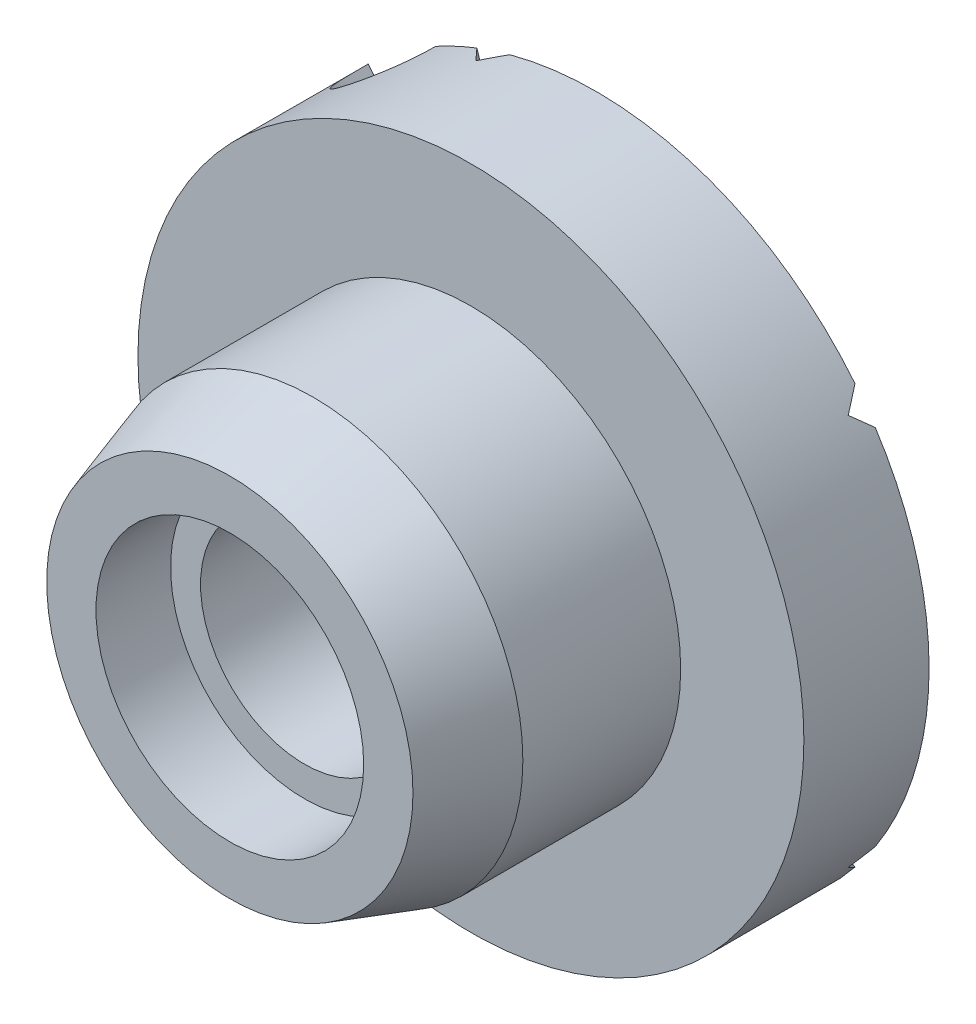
from build123d import *

# Parameters (mm, degrees)
CUT_EXTRUDE_1_DEPTH      = 7.62
PATTERN_CIRCULAR_1_COUNT = 5


with BuildPart() as part:
    # Sketch 1 → Revolve 1 (revolve)
    with BuildSketch(Plane(origin=(0, 0, 0), x_dir=(0, 0, -1), z_dir=(1, 0, 0)), mode=Mode.PRIVATE) as revolve_1_sk:
        Polygon((1.4224, 1.9812), (1.4224, 2.5527), (0, 2.5527), (0, 3.4925), (1.5875, 4.0005), (4.5974, 4.0005), (4.5974, 6.35), (6.985, 6.35), (6.985, 1.9812), align=None)
    revolve(revolve_1_sk.sketch.rotate(Axis((0, 0, 0), (0, 0, -1)), 90), axis=Axis((0, 0, 0), (0, 0, -1)))

    # Sketch 2 → Cut-Extrude 1 (cut)
    with BuildSketch(Plane(origin=(0, 0, 0), x_dir=(0, 0, -1), z_dir=(1, 0, 0))):
        Polygon((6.985, 0.3302), (6.985, -0.3302), (6.6548, 0), align=None)
    cut_extrude_1 = extrude(amount=-CUT_EXTRUDE_1_DEPTH, mode=Mode.SUBTRACT)

    # Pattern Circular 1: Cut-Extrude 1 ×5 about axis
    pattern_circular_1_axis = Axis((0, 0, 0), (0, 0, 1))
    for i in range(1, PATTERN_CIRCULAR_1_COUNT):
        add(cut_extrude_1.rotate(pattern_circular_1_axis, i * 360 / PATTERN_CIRCULAR_1_COUNT), mode=Mode.SUBTRACT)

    # Sketch 3 → Cut-Revolve 1 (revolve, cut)
    with BuildSketch(Plane(origin=(0, 0, 0), x_dir=(0, 0, -1), z_dir=(0.8090169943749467, 0.5877852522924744, 0))):
        Polygon((8.420086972, 4.846820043), (7.858820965, 4.285554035), (5.137232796, 7.007142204), (5.698498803, 7.568408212), align=None)
    revolve(axis=Axis((-2.402258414, 3.306425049, -9.179940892), (-0.41562693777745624, 0.5720614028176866, 0.7071067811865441)), mode=Mode.SUBTRACT)


solid = part.part
